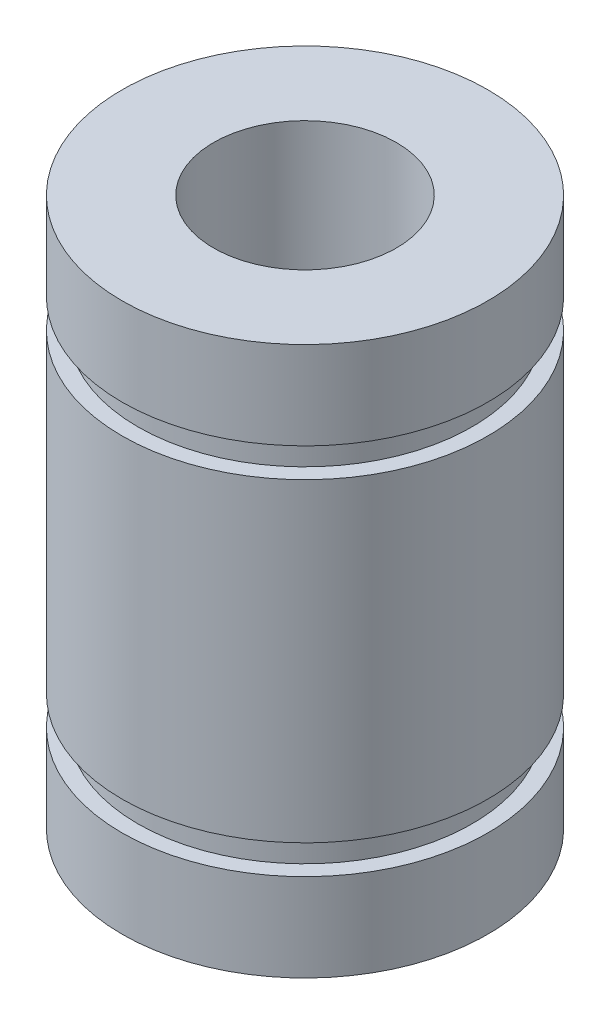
from build123d import *

# Parameters (mm, degrees)
SKETCH1_R           = 6.35
SKETCH1_R_2         = 3.175
BOSS_EXTRUDE1_DEPTH = 19.05
SKETCH2_W           = 0.546662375
SKETCH2_H           = 1.016


with BuildPart() as part:
    # Sketch1 → Boss-Extrude1 (new body)
    with BuildSketch(Plane(origin=(0, 0, 0), x_dir=(1, 0, 0), z_dir=(0, 1, 0))):
        with Locations(Location((0, 0, 0), (0, 0, 90))):
            Circle(SKETCH1_R)
        with Locations(Location((0, 0, 0), (0, 0, 90))):
            Circle(SKETCH1_R_2, mode=Mode.SUBTRACT)
    extrude(amount=BOSS_EXTRUDE1_DEPTH)

    # Sketch2 → Cut-Revolve1 (revolve, cut)
    with BuildSketch(Plane.XY, mode=Mode.PRIVATE) as cut_revolve1_sk:
        with Locations((-6.076668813, 15.494)):
            Rectangle(SKETCH2_W, SKETCH2_H)
        with Locations((-6.076668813, 3.556)):
            Rectangle(SKETCH2_W, SKETCH2_H)
    revolve(cut_revolve1_sk.sketch.rotate(Axis((0, 0, 0), (0, 1, 0)), 270), axis=Axis((0, 0, 0), (0, 1, 0)), mode=Mode.SUBTRACT)


solid = part.part
